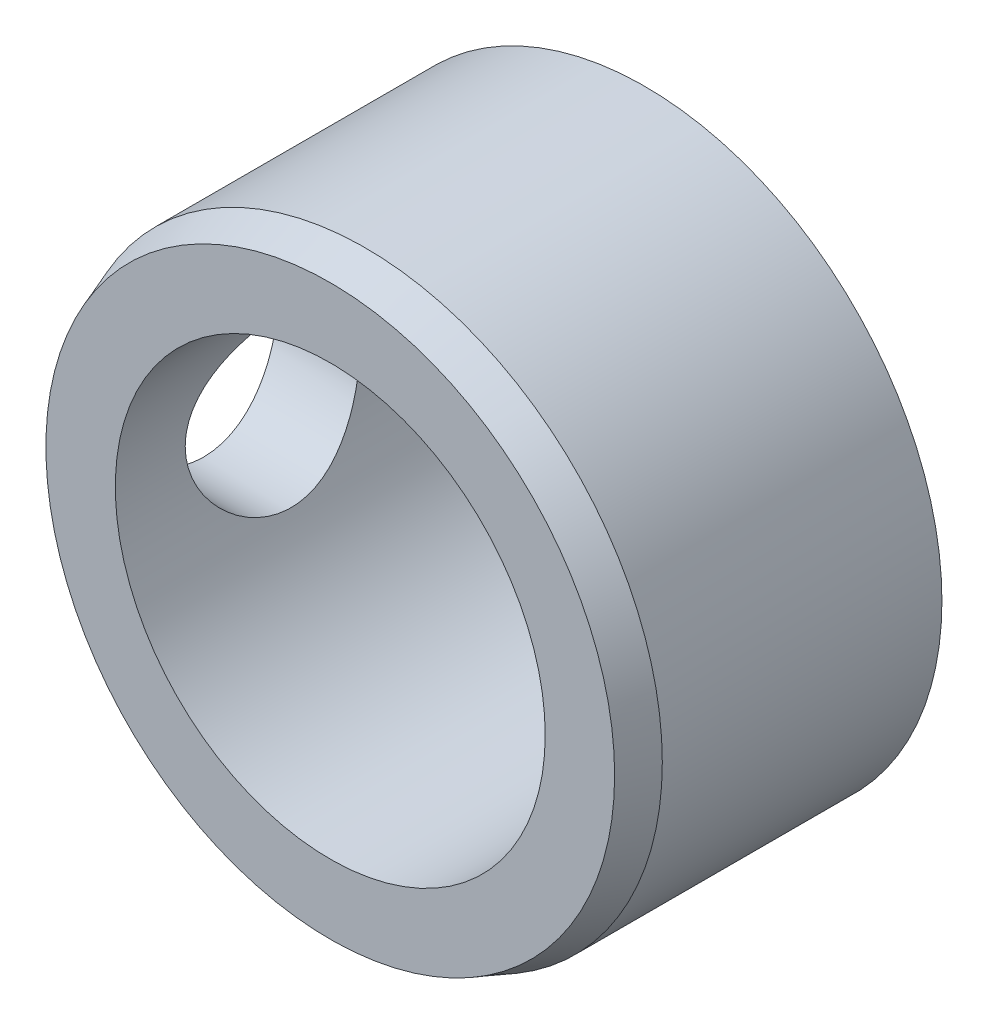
ISO-10303-21;
HEADER;
FILE_DESCRIPTION(('STEP AP214'),'2;1');
FILE_NAME('part.step','',(''),(''),'','','');
FILE_SCHEMA(('AUTOMOTIVE_DESIGN { 1 0 10303 214 1 1 1 1 }'));
ENDSEC;
DATA;
#1=APPLICATION_CONTEXT('core data for automotive mechanical design processes');
#2=APPLICATION_PROTOCOL_DEFINITION('international standard','automotive_design',2000,#1);
#3=PRODUCT_CONTEXT('',#1,'mechanical');
#4=PRODUCT('Part','Part','',(#3));
#5=PRODUCT_RELATED_PRODUCT_CATEGORY('part','',(#4));
#6=PRODUCT_DEFINITION_FORMATION('','',#4);
#7=PRODUCT_DEFINITION_CONTEXT('part definition',#1,'design');
#8=PRODUCT_DEFINITION('design','',#6,#7);
#9=PRODUCT_DEFINITION_SHAPE('','',#8);
#10=(LENGTH_UNIT() NAMED_UNIT(*) SI_UNIT(.MILLI.,.METRE.));
#11=(NAMED_UNIT(*) PLANE_ANGLE_UNIT() SI_UNIT($,.RADIAN.));
#12=(NAMED_UNIT(*) SI_UNIT($,.STERADIAN.) SOLID_ANGLE_UNIT());
#13=UNCERTAINTY_MEASURE_WITH_UNIT(LENGTH_MEASURE(1.E-05),#10,'distance_accuracy_value','');
#14=(GEOMETRIC_REPRESENTATION_CONTEXT(3) GLOBAL_UNCERTAINTY_ASSIGNED_CONTEXT((#13)) GLOBAL_UNIT_ASSIGNED_CONTEXT((#10,
#11,#12)) REPRESENTATION_CONTEXT('',''));
#15=CARTESIAN_POINT('',(0.,0.,0.));
#16=DIRECTION('',(0.,0.,1.));
#17=DIRECTION('',(1.,0.,0.));
#18=AXIS2_PLACEMENT_3D('',#15,#16,#17);
#19=CARTESIAN_POINT('',(0.,0.,18.));
#20=DIRECTION('',(0.,0.,-1.));
#21=DIRECTION('',(-1.,0.,0.));
#22=AXIS2_PLACEMENT_3D('',#19,#20,#21);
#23=CYLINDRICAL_SURFACE('',#22,17.);
#24=CARTESIAN_POINT('',(0.,0.,16.));
#25=DIRECTION('',(0.,0.,1.));
#26=DIRECTION('',(1.,0.,0.));
#27=AXIS2_PLACEMENT_3D('',#24,#25,#26);
#28=CIRCLE('',#27,17.);
#29=CARTESIAN_POINT('',(17.,0.,16.));
#30=VERTEX_POINT('',#29);
#31=EDGE_CURVE('E10',#30,#30,#28,.F.);
#32=ORIENTED_EDGE('',*,*,#31,.T.);
#33=EDGE_LOOP('',(#32));
#34=FACE_BOUND('',#33,.T.);
#35=CARTESIAN_POINT('',(0.,0.,0.));
#36=DIRECTION('',(0.,0.,1.));
#37=DIRECTION('',(1.,0.,0.));
#38=AXIS2_PLACEMENT_3D('',#35,#36,#37);
#39=CIRCLE('',#38,17.);
#40=CARTESIAN_POINT('',(17.,0.,0.));
#41=VERTEX_POINT('',#40);
#42=EDGE_CURVE('E53',#41,#41,#39,.T.);
#43=ORIENTED_EDGE('',*,*,#42,.T.);
#44=EDGE_LOOP('',(#43));
#45=FACE_BOUND('',#44,.T.);
#46=CARTESIAN_POINT('',(-17.,0.,14.));
#47=CARTESIAN_POINT('',(-16.9999972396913,0.274542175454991,13.9999960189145));
#48=CARTESIAN_POINT('',(-16.9932854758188,0.549124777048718,13.9773128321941));
#49=CARTESIAN_POINT('',(-16.9671658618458,1.09030958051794,13.8873845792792));
#50=CARTESIAN_POINT('',(-16.9477538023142,1.35690910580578,13.8201247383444));
#51=CARTESIAN_POINT('',(-16.8983635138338,1.87424279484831,13.6434716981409));
#52=CARTESIAN_POINT('',(-16.8684005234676,2.12499922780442,13.5341392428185));
#53=CARTESIAN_POINT('',(-16.8010321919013,2.60462027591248,13.2766892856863));
#54=CARTESIAN_POINT('',(-16.7636259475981,2.83348222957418,13.1285670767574));
#55=CARTESIAN_POINT('',(-16.6842112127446,3.26915832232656,12.7934165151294));
#56=CARTESIAN_POINT('',(-16.6421111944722,3.47528005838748,12.6055098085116));
#57=CARTESIAN_POINT('',(-16.558607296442,3.8535869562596,12.197997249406));
#58=CARTESIAN_POINT('',(-16.5172035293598,4.02576667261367,11.9783863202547));
#59=CARTESIAN_POINT('',(-16.4388177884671,4.33489560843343,11.5079021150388));
#60=CARTESIAN_POINT('',(-16.4019498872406,4.47100870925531,11.2564586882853));
#61=CARTESIAN_POINT('',(-16.3381741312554,4.69873934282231,10.7329924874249));
#62=CARTESIAN_POINT('',(-16.3112639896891,4.79036709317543,10.4609744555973));
#63=CARTESIAN_POINT('',(-16.2714028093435,4.92404618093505,9.91183715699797));
#64=CARTESIAN_POINT('',(-16.2580942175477,4.96737026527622,9.63505435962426));
#65=CARTESIAN_POINT('',(-16.2458784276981,5.0071854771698,9.07785359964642));
#66=CARTESIAN_POINT('',(-16.2469678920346,5.00368745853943,8.79743649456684));
#67=CARTESIAN_POINT('',(-16.2631076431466,4.95095940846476,8.25119811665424));
#68=CARTESIAN_POINT('',(-16.2776742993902,4.90331354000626,7.98520728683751));
#69=CARTESIAN_POINT('',(-16.3183462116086,4.76619765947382,7.46517447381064));
#70=CARTESIAN_POINT('',(-16.3444525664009,4.67672366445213,7.21113363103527));
#71=CARTESIAN_POINT('',(-16.4056554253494,4.45730211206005,6.71829070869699));
#72=CARTESIAN_POINT('',(-16.4408666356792,4.326833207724,6.47973559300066));
#73=CARTESIAN_POINT('',(-16.5162554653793,4.02948792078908,6.02736924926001));
#74=CARTESIAN_POINT('',(-16.5564342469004,3.86260301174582,5.81356383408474));
#75=CARTESIAN_POINT('',(-16.6392021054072,3.48925235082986,5.40776826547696));
#76=CARTESIAN_POINT('',(-16.6818232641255,3.28146894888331,5.21699493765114));
#77=CARTESIAN_POINT('',(-16.7632443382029,2.83632910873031,4.87272397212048));
#78=CARTESIAN_POINT('',(-16.8020440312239,2.59897095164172,4.71922850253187));
#79=CARTESIAN_POINT('',(-16.8717818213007,2.09926848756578,4.45316996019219));
#80=CARTESIAN_POINT('',(-16.9026694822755,1.83677785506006,4.34086760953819));
#81=CARTESIAN_POINT('',(-16.9527396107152,1.29551766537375,4.16235794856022));
#82=CARTESIAN_POINT('',(-16.9719252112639,1.01675248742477,4.09613829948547));
#83=CARTESIAN_POINT('',(-16.9959379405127,0.461208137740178,4.0136782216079));
#84=CARTESIAN_POINT('',(-17.0012389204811,0.18469399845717,3.99578773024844));
#85=CARTESIAN_POINT('',(-16.9982701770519,-0.367399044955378,4.00588146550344));
#86=CARTESIAN_POINT('',(-16.9900021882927,-0.642978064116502,4.03385982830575));
#87=CARTESIAN_POINT('',(-16.961134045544,-1.17921271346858,4.13355888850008));
#88=CARTESIAN_POINT('',(-16.9408036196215,-1.44006199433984,4.20432348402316));
#89=CARTESIAN_POINT('',(-16.8901536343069,-1.94613518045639,4.3864433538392));
#90=CARTESIAN_POINT('',(-16.8598328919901,-2.19135723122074,4.49780343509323));
#91=CARTESIAN_POINT('',(-16.7915033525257,-2.66534944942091,4.76077579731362));
#92=CARTESIAN_POINT('',(-16.7533367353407,-2.8936244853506,4.91323842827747));
#93=CARTESIAN_POINT('',(-16.673704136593,-3.32191560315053,5.25304844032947));
#94=CARTESIAN_POINT('',(-16.6322373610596,-3.52192485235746,5.4404042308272));
#95=CARTESIAN_POINT('',(-16.5488725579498,-3.89521688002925,5.85242814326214));
#96=CARTESIAN_POINT('',(-16.5070097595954,-4.06732704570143,6.07816802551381));
#97=CARTESIAN_POINT('',(-16.4291353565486,-4.37129517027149,6.55623274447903));
#98=CARTESIAN_POINT('',(-16.3931235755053,-4.50315434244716,6.80855677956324));
#99=CARTESIAN_POINT('',(-16.3314467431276,-4.72194711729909,7.33171455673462));
#100=CARTESIAN_POINT('',(-16.3057305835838,-4.80910325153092,7.60244886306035));
#101=CARTESIAN_POINT('',(-16.26766584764,-4.93634927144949,8.15564231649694));
#102=CARTESIAN_POINT('',(-16.2553129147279,-4.97645449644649,8.43809761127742));
#103=CARTESIAN_POINT('',(-16.2457908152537,-5.00744547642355,8.99456751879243));
#104=CARTESIAN_POINT('',(-16.2480335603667,-5.00023747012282,9.26846732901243));
#105=CARTESIAN_POINT('',(-16.2660429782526,-4.94133317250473,9.81096453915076));
#106=CARTESIAN_POINT('',(-16.2818091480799,-4.88963853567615,10.0795621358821));
#107=CARTESIAN_POINT('',(-16.3247022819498,-4.74443717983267,10.600847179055));
#108=CARTESIAN_POINT('',(-16.3516969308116,-4.65141659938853,10.8536817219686));
#109=CARTESIAN_POINT('',(-16.413985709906,-4.42658103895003,11.3403567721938));
#110=CARTESIAN_POINT('',(-16.4492813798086,-4.2947588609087,11.5741937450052));
#111=CARTESIAN_POINT('',(-16.525744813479,-3.99063021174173,12.0251290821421));
#112=CARTESIAN_POINT('',(-16.5670754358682,-3.81706300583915,12.2413495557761));
#113=CARTESIAN_POINT('',(-16.6501406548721,-3.43666397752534,12.6422138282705));
#114=CARTESIAN_POINT('',(-16.6918753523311,-3.22982363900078,12.8268495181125));
#115=CARTESIAN_POINT('',(-16.7724327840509,-2.78184131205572,13.1643920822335));
#116=CARTESIAN_POINT('',(-16.8111427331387,-2.53990743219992,13.3162775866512));
#117=CARTESIAN_POINT('',(-16.8799593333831,-2.03279874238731,13.5769984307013));
#118=CARTESIAN_POINT('',(-16.9100702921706,-1.7676356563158,13.6858553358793));
#119=CARTESIAN_POINT('',(-16.9554297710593,-1.25377523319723,13.8468355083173));
#120=CARTESIAN_POINT('',(-16.97200860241,-1.00680227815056,13.9041208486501));
#121=CARTESIAN_POINT('',(-16.9942941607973,-0.506563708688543,13.9807020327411));
#122=CARTESIAN_POINT('',(-17.0000025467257,-0.253299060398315,14.000003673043));
#123=CARTESIAN_POINT('',(-17.,0.,14.));
#124=B_SPLINE_CURVE_WITH_KNOTS('',3,(#46,#47,#48,#49,#50,#51,#52,#53,#54,#55,#56,#57,#58,#59,
#60,#61,#62,#63,#64,#65,#66,#67,#68,#69,#70,#71,#72,#73,#74,#75,#76,#77,#78,#79,#80,#81,#82,#83,
#84,#85,#86,#87,#88,#89,#90,#91,#92,#93,#94,#95,#96,#97,#98,#99,#100,#101,#102,#103,#104,#105,
#106,#107,#108,#109,#110,#111,#112,#113,#114,#115,#116,#117,#118,#119,#120,#121,#122,#123),
.UNSPECIFIED.,.T.,.F.,(4,2,2,2,2,2,2,2,2,2,2,2,2,2,2,2,2,2,2,2,2,2,2,2,2,2,2,2,2,2,2,2,2,2,2,2,
2,2,4),(0.,0.822696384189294,1.64566558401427,2.46745102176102,3.28933622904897,
4.13172361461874,4.97424603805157,5.83486437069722,6.69528493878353,7.53245524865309,
8.36943149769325,9.17749119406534,9.98562785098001,10.8044888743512,11.623541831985,
12.4754016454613,13.3273109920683,14.18452287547,15.0415051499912,15.8688347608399,
16.6960586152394,17.5054473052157,18.3149318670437,19.1426539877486,19.9705758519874,
20.8273157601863,21.6840298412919,22.5364367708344,23.3885657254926,24.2065793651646,
25.024562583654,25.8331682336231,26.6419239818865,27.4791225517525,28.3165357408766,
29.1771614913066,30.0373553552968,30.796510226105,31.5555492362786),.UNSPECIFIED.);
#125=CARTESIAN_POINT('',(-17.,0.,14.));
#126=VERTEX_POINT('',#125);
#127=EDGE_CURVE('E64',#126,#126,#124,.T.);
#128=ORIENTED_EDGE('',*,*,#127,.F.);
#129=EDGE_LOOP('',(#128));
#130=FACE_BOUND('',#129,.T.);
#131=ADVANCED_FACE('F37',(#34,#45,#130),#23,.T.);
#132=CARTESIAN_POINT('',(0.,0.,0.));
#133=DIRECTION('',(0.,0.,1.));
#134=DIRECTION('',(1.,0.,0.));
#135=AXIS2_PLACEMENT_3D('',#132,#133,#134);
#136=CYLINDRICAL_SURFACE('',#135,12.3);
#137=CARTESIAN_POINT('',(0.,0.,18.));
#138=DIRECTION('',(0.,0.,1.));
#139=DIRECTION('',(1.,0.,0.));
#140=AXIS2_PLACEMENT_3D('',#137,#138,#139);
#141=CIRCLE('',#140,12.3);
#142=CARTESIAN_POINT('',(12.3,0.,18.));
#143=VERTEX_POINT('',#142);
#144=EDGE_CURVE('E61',#143,#143,#141,.T.);
#145=ORIENTED_EDGE('',*,*,#144,.T.);
#146=EDGE_LOOP('',(#145));
#147=FACE_BOUND('',#146,.T.);
#148=CARTESIAN_POINT('',(0.,0.,0.));
#149=DIRECTION('',(0.,0.,1.));
#150=DIRECTION('',(1.,0.,0.));
#151=AXIS2_PLACEMENT_3D('',#148,#149,#150);
#152=CIRCLE('',#151,12.3);
#153=CARTESIAN_POINT('',(12.3,0.,0.));
#154=VERTEX_POINT('',#153);
#155=EDGE_CURVE('E58',#154,#154,#152,.T.);
#156=ORIENTED_EDGE('',*,*,#155,.F.);
#157=EDGE_LOOP('',(#156));
#158=FACE_BOUND('',#157,.T.);
#159=CARTESIAN_POINT('',(-12.3,0.,14.));
#160=CARTESIAN_POINT('',(-12.299999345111,-0.134251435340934,13.9999991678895));
#161=CARTESIAN_POINT('',(-12.297795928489,-0.268552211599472,13.9945855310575));
#162=CARTESIAN_POINT('',(-12.2890373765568,-0.536201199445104,13.9729804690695));
#163=CARTESIAN_POINT('',(-12.2824793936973,-0.669548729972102,13.9567819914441));
#164=CARTESIAN_POINT('',(-12.2651667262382,-0.934530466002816,13.913726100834));
#165=CARTESIAN_POINT('',(-12.2544031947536,-1.06616045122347,13.8868462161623));
#166=CARTESIAN_POINT('',(-12.228959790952,-1.32652358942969,13.8226884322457));
#167=CARTESIAN_POINT('',(-12.214278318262,-1.45525553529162,13.785406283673));
#168=CARTESIAN_POINT('',(-12.181439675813,-1.70843595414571,13.7009553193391));
#169=CARTESIAN_POINT('',(-12.1632957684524,-1.83289870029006,13.653824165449));
#170=CARTESIAN_POINT('',(-12.1239527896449,-2.07728767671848,13.5500034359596));
#171=CARTESIAN_POINT('',(-12.1027525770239,-2.19721219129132,13.4933102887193));
#172=CARTESIAN_POINT('',(-12.0353555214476,-2.54891907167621,13.3096188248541));
#173=CARTESIAN_POINT('',(-11.9853151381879,-2.77298158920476,13.1688918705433));
#174=CARTESIAN_POINT('',(-11.877399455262,-3.20455622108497,12.8479148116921));
#175=CARTESIAN_POINT('',(-11.8192760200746,-3.41090339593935,12.6661959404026));
#176=CARTESIAN_POINT('',(-11.7028078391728,-3.79128869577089,12.2712696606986));
#177=CARTESIAN_POINT('',(-11.6444629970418,-3.96531055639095,12.058046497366));
#178=CARTESIAN_POINT('',(-11.5601834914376,-4.20233997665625,11.7131318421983));
#179=CARTESIAN_POINT('',(-11.5320468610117,-4.27874761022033,11.5909726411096));
#180=CARTESIAN_POINT('',(-11.4782893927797,-4.42093201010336,11.3401098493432));
#181=CARTESIAN_POINT('',(-11.452667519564,-4.48671315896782,11.2114089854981));
#182=CARTESIAN_POINT('',(-11.404779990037,-4.6070810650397,10.9482672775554));
#183=CARTESIAN_POINT('',(-11.3825145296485,-4.66166716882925,10.8138260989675));
#184=CARTESIAN_POINT('',(-11.3421317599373,-4.75907860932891,10.5402086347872));
#185=CARTESIAN_POINT('',(-11.3240123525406,-4.80190989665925,10.4010347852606));
#186=CARTESIAN_POINT('',(-11.2933071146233,-4.8736708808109,10.1254610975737));
#187=CARTESIAN_POINT('',(-11.2805050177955,-4.90314958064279,9.9892283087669));
#188=CARTESIAN_POINT('',(-11.2597389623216,-4.95065178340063,9.71447315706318));
#189=CARTESIAN_POINT('',(-11.2517727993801,-4.9686805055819,9.57595186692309));
#190=CARTESIAN_POINT('',(-11.2409660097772,-4.99308143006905,9.29771805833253));
#191=CARTESIAN_POINT('',(-11.2381242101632,-4.99945629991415,9.15800581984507));
#192=CARTESIAN_POINT('',(-11.2376702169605,-5.00047694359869,8.87853354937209));
#193=CARTESIAN_POINT('',(-11.2400577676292,-4.99512329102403,8.73877352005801));
#194=CARTESIAN_POINT('',(-11.2496101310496,-4.97356967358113,8.47049089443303));
#195=CARTESIAN_POINT('',(-11.2564156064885,-4.95818519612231,8.34188896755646));
#196=CARTESIAN_POINT('',(-11.2742287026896,-4.91754601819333,8.08650898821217));
#197=CARTESIAN_POINT('',(-11.2852377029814,-4.89228807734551,7.95973154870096));
#198=CARTESIAN_POINT('',(-11.3111165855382,-4.83215395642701,7.70891109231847));
#199=CARTESIAN_POINT('',(-11.3259855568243,-4.79728004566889,7.58486743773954));
#200=CARTESIAN_POINT('',(-11.359141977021,-4.71823301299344,7.34023236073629));
#201=CARTESIAN_POINT('',(-11.3774307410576,-4.67405631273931,7.21964228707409));
#202=CARTESIAN_POINT('',(-11.4374788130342,-4.52610348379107,6.85929921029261));
#203=CARTESIAN_POINT('',(-11.4838742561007,-4.40810797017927,6.62597561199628));
#204=CARTESIAN_POINT('',(-11.5838603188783,-4.13821413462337,6.1816859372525));
#205=CARTESIAN_POINT('',(-11.6374536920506,-3.98630282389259,5.97072847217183));
#206=CARTESIAN_POINT('',(-11.751028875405,-3.63859580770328,5.55923690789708));
#207=CARTESIAN_POINT('',(-11.8111786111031,-3.44026022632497,5.36088986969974));
#208=CARTESIAN_POINT('',(-11.9274734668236,-3.01236694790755,4.99950264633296));
#209=CARTESIAN_POINT('',(-11.9836177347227,-2.78280263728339,4.83646995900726));
#210=CARTESIAN_POINT('',(-12.0608933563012,-2.41680734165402,4.62052996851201));
#211=CARTESIAN_POINT('',(-12.0857228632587,-2.28971386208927,4.55275065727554));
#212=CARTESIAN_POINT('',(-12.1320984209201,-2.02967640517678,4.42822124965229));
#213=CARTESIAN_POINT('',(-12.1536457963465,-1.89673481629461,4.37146670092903));
#214=CARTESIAN_POINT('',(-12.1928247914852,-1.62595874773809,4.26954670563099));
#215=CARTESIAN_POINT('',(-12.2104572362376,-1.48812530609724,4.22437881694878));
#216=CARTESIAN_POINT('',(-12.2412854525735,-1.20859111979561,4.14609780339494));
#217=CARTESIAN_POINT('',(-12.2544815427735,-1.06689065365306,4.11298381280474));
#218=CARTESIAN_POINT('',(-12.2753763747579,-0.789489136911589,4.06083015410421));
#219=CARTESIAN_POINT('',(-12.2833605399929,-0.65394703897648,4.04105726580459));
#220=CARTESIAN_POINT('',(-12.2948376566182,-0.381511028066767,4.0126958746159));
#221=CARTESIAN_POINT('',(-12.2983308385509,-0.244617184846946,4.00410679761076));
#222=CARTESIAN_POINT('',(-12.3007278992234,0.0294214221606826,3.99820893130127));
#223=CARTESIAN_POINT('',(-12.2996328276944,0.166566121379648,4.00089756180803));
#224=CARTESIAN_POINT('',(-12.2928865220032,0.440057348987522,4.01751899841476));
#225=CARTESIAN_POINT('',(-12.2872353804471,0.576403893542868,4.03145157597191));
#226=CARTESIAN_POINT('',(-12.2719047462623,0.84087393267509,4.06948964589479));
#227=CARTESIAN_POINT('',(-12.2624270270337,0.969082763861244,4.09308634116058));
#228=CARTESIAN_POINT('',(-12.2397119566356,1.22299050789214,4.15013064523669));
#229=CARTESIAN_POINT('',(-12.2264733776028,1.34868858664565,4.18358147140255));
#230=CARTESIAN_POINT('',(-12.1965631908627,1.59669505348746,4.26002196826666));
#231=CARTESIAN_POINT('',(-12.1798925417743,1.71900437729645,4.30300897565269));
#232=CARTESIAN_POINT('',(-12.1435167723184,1.95954960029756,4.39816095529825));
#233=CARTESIAN_POINT('',(-12.1238104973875,2.07778392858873,4.4503294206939));
#234=CARTESIAN_POINT('',(-12.0595257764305,2.43238523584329,4.62347667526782));
#235=CARTESIAN_POINT('',(-12.0107173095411,2.66118345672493,4.75879643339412));
#236=CARTESIAN_POINT('',(-11.9067120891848,3.09351645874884,5.06297460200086));
#237=CARTESIAN_POINT('',(-11.8515127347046,3.29704088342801,5.23184668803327));
#238=CARTESIAN_POINT('',(-11.7360439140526,3.68775318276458,5.61182932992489));
#239=CARTESIAN_POINT('',(-11.6756852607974,3.87288297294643,5.82503390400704));
#240=CARTESIAN_POINT('',(-11.5601209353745,4.20531673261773,6.28067313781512));
#241=CARTESIAN_POINT('',(-11.5049162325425,4.35261359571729,6.52311327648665));
#242=CARTESIAN_POINT('',(-11.4307004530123,4.54244025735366,6.90551037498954));
#243=CARTESIAN_POINT('',(-11.4072760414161,4.60079172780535,7.03697188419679));
#244=CARTESIAN_POINT('',(-11.3642296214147,4.7061159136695,7.30495892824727));
#245=CARTESIAN_POINT('',(-11.3446059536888,4.75309359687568,7.44148222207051));
#246=CARTESIAN_POINT('',(-11.3098728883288,4.83515902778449,7.71855094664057));
#247=CARTESIAN_POINT('',(-11.2947616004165,4.87025175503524,7.85909466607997));
#248=CARTESIAN_POINT('',(-11.2696148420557,4.92816218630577,8.14313551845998));
#249=CARTESIAN_POINT('',(-11.2595789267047,4.95098096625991,8.28663239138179));
#250=CARTESIAN_POINT('',(-11.2455202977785,4.98282551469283,8.56462732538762));
#251=CARTESIAN_POINT('',(-11.241106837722,4.99274868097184,8.69900354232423));
#252=CARTESIAN_POINT('',(-11.237121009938,5.00171342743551,8.96823954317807));
#253=CARTESIAN_POINT('',(-11.2375502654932,5.00075135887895,9.10309947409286));
#254=CARTESIAN_POINT('',(-11.2432380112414,4.98795018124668,9.37212841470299));
#255=CARTESIAN_POINT('',(-11.2484940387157,4.97611661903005,9.50629774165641));
#256=CARTESIAN_POINT('',(-11.2636513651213,4.94171123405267,9.77303438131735));
#257=CARTESIAN_POINT('',(-11.2735544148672,4.91913536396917,9.90560107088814));
#258=CARTESIAN_POINT('',(-11.2971578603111,4.86467520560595,10.1625101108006));
#259=CARTESIAN_POINT('',(-11.310678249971,4.83322907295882,10.2869620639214));
#260=CARTESIAN_POINT('',(-11.3412640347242,4.76101455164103,10.5326991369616));
#261=CARTESIAN_POINT('',(-11.3583306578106,4.7202429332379,10.6539831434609));
#262=CARTESIAN_POINT('',(-11.4141396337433,4.58443575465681,11.01195605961));
#263=CARTESIAN_POINT('',(-11.4575089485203,4.47586877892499,11.2429482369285));
#264=CARTESIAN_POINT('',(-11.5548010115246,4.21859179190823,11.6973544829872));
#265=CARTESIAN_POINT('',(-11.6091922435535,4.06790731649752,11.9195376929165));
#266=CARTESIAN_POINT('',(-11.7210585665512,3.73333598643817,12.3367074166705));
#267=CARTESIAN_POINT('',(-11.7785346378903,3.54943853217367,12.5316852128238));
#268=CARTESIAN_POINT('',(-11.8647076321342,3.24513417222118,12.8065142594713));
#269=CARTESIAN_POINT('',(-11.8943472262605,3.13501910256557,12.8977084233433));
#270=CARTESIAN_POINT('',(-11.9520850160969,2.90713856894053,13.0704990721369));
#271=CARTESIAN_POINT('',(-11.9801837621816,2.78937586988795,13.1520989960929));
#272=CARTESIAN_POINT('',(-12.0340901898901,2.54678816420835,13.3051673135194));
#273=CARTESIAN_POINT('',(-12.0598957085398,2.42195666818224,13.376626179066));
#274=CARTESIAN_POINT('',(-12.1084516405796,2.16617872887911,13.5086995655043));
#275=CARTESIAN_POINT('',(-12.131203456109,2.03523512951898,13.5693190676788));
#276=CARTESIAN_POINT('',(-12.1726454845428,1.77040965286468,13.6782251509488));
#277=CARTESIAN_POINT('',(-12.1913994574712,1.63661849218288,13.7267078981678));
#278=CARTESIAN_POINT('',(-12.2247925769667,1.36497550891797,13.8121826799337));
#279=CARTESIAN_POINT('',(-12.2394336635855,1.22712563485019,13.8491801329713));
#280=CARTESIAN_POINT('',(-12.2641505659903,0.948732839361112,13.9112317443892));
#281=CARTESIAN_POINT('',(-12.2742377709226,0.808197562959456,13.9363157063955));
#282=CARTESIAN_POINT('',(-12.2895926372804,0.525307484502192,13.9743736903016));
#283=CARTESIAN_POINT('',(-12.2948639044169,0.382954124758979,13.9873567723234));
#284=CARTESIAN_POINT('',(-12.2984343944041,0.200298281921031,13.996147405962));
#285=CARTESIAN_POINT('',(-12.2990212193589,0.160255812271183,13.9975917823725));
#286=CARTESIAN_POINT('',(-12.2998041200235,0.0801436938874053,13.9995182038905));
#287=CARTESIAN_POINT('',(-12.3000001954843,0.0400740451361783,14.0000002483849));
#288=CARTESIAN_POINT('',(-12.3,0.,14.));
#289=B_SPLINE_CURVE_WITH_KNOTS('',3,(#159,#160,#161,#162,#163,#164,#165,#166,#167,#168,#169,
#170,#171,#172,#173,#174,#175,#176,#177,#178,#179,#180,#181,#182,#183,#184,#185,#186,#187,#188,
#189,#190,#191,#192,#193,#194,#195,#196,#197,#198,#199,#200,#201,#202,#203,#204,#205,#206,#207,
#208,#209,#210,#211,#212,#213,#214,#215,#216,#217,#218,#219,#220,#221,#222,#223,#224,#225,#226,
#227,#228,#229,#230,#231,#232,#233,#234,#235,#236,#237,#238,#239,#240,#241,#242,#243,#244,#245,
#246,#247,#248,#249,#250,#251,#252,#253,#254,#255,#256,#257,#258,#259,#260,#261,#262,#263,#264,
#265,#266,#267,#268,#269,#270,#271,#272,#273,#274,#275,#276,#277,#278,#279,#280,#281,#282,#283,
#284,#285,#286,#287,#288),.UNSPECIFIED.,.T.,.F.,(4,2,2,2,2,2,2,2,2,2,2,2,2,2,2,2,2,2,2,2,2,2,2,
2,2,2,2,2,2,2,2,2,2,2,2,2,2,2,2,2,2,2,2,2,2,2,2,2,2,2,2,2,2,2,2,2,2,2,2,2,2,2,2,2,4),(0.,
0.402713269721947,0.80569014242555,1.20951933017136,1.613513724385,2.01599065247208,
2.41861824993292,3.22277966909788,4.06238927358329,4.90242018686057,5.34238819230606,
5.78217428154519,6.22198603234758,6.66157472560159,7.08093524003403,7.50010445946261,
7.91917772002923,8.33823048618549,8.72686624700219,9.11562966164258,9.50430140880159,
9.89312293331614,10.6861079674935,11.4793972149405,12.3362046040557,13.1931937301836,
13.6312061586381,14.0690413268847,14.5067841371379,14.94449550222,15.355597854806,
15.7666791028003,16.1776663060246,16.5886451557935,16.980311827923,17.3721065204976,
17.7637919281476,18.1556266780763,18.9626325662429,19.7699680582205,20.6323142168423,
21.4948222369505,21.9315156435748,22.3680179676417,22.8043371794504,23.2406181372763,
23.6445443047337,24.0486058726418,24.4524613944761,24.8564691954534,25.2432429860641,
25.6301509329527,26.4034111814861,27.2218406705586,28.0405318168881,28.4781381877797,
28.915587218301,29.3534445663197,29.7911001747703,30.2211437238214,30.6509840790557,
31.0797433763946,31.5081813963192,31.6283912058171,31.7486010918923),.UNSPECIFIED.);
#290=CARTESIAN_POINT('',(-12.3,0.,14.));
#291=VERTEX_POINT('',#290);
#292=EDGE_CURVE('E41',#291,#291,#289,.T.);
#293=ORIENTED_EDGE('',*,*,#292,.F.);
#294=EDGE_LOOP('',(#293));
#295=FACE_BOUND('',#294,.T.);
#296=ADVANCED_FACE('F78',(#147,#158,#295),#136,.F.);
#297=CARTESIAN_POINT('',(0.,0.,18.));
#298=DIRECTION('',(0.,0.,1.));
#299=DIRECTION('',(1.,0.,0.));
#300=AXIS2_PLACEMENT_3D('',#297,#298,#299);
#301=PLANE('',#300);
#302=CARTESIAN_POINT('',(0.,0.,18.));
#303=DIRECTION('',(0.,0.,1.));
#304=DIRECTION('',(1.,0.,0.));
#305=AXIS2_PLACEMENT_3D('',#302,#303,#304);
#306=CIRCLE('',#305,16.2720595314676);
#307=CARTESIAN_POINT('',(16.2720595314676,0.,18.));
#308=VERTEX_POINT('',#307);
#309=EDGE_CURVE('E49',#308,#308,#306,.T.);
#310=ORIENTED_EDGE('',*,*,#309,.T.);
#311=EDGE_LOOP('',(#310));
#312=FACE_BOUND('',#311,.T.);
#313=ORIENTED_EDGE('',*,*,#144,.F.);
#314=EDGE_LOOP('',(#313));
#315=FACE_BOUND('',#314,.T.);
#316=ADVANCED_FACE('F82',(#312,#315),#301,.T.);
#317=CARTESIAN_POINT('',(0.,0.,0.));
#318=DIRECTION('',(0.,0.,1.));
#319=DIRECTION('',(1.,0.,0.));
#320=AXIS2_PLACEMENT_3D('',#317,#318,#319);
#321=PLANE('',#320);
#322=ORIENTED_EDGE('',*,*,#155,.T.);
#323=EDGE_LOOP('',(#322));
#324=FACE_BOUND('',#323,.T.);
#325=ORIENTED_EDGE('',*,*,#42,.F.);
#326=EDGE_LOOP('',(#325));
#327=FACE_BOUND('',#326,.T.);
#328=ADVANCED_FACE('F76',(#324,#327),#321,.F.);
#329=CARTESIAN_POINT('',(0.,0.,18.));
#330=DIRECTION('',(0.,0.,-1.));
#331=DIRECTION('',(-1.,0.,0.));
#332=AXIS2_PLACEMENT_3D('',#329,#330,#331);
#333=CONICAL_SURFACE('',#332,16.2720595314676,0.349065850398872);
#334=ORIENTED_EDGE('',*,*,#31,.F.);
#335=EDGE_LOOP('',(#334));
#336=FACE_BOUND('',#335,.T.);
#337=ORIENTED_EDGE('',*,*,#309,.F.);
#338=EDGE_LOOP('',(#337));
#339=FACE_BOUND('',#338,.T.);
#340=ADVANCED_FACE('F72',(#336,#339),#333,.T.);
#341=CARTESIAN_POINT('',(-7.,0.,9.));
#342=DIRECTION('',(-1.,0.,0.));
#343=DIRECTION('',(0.,0.,1.));
#344=AXIS2_PLACEMENT_3D('',#341,#342,#343);
#345=CYLINDRICAL_SURFACE('',#344,5.);
#346=ORIENTED_EDGE('',*,*,#292,.T.);
#347=EDGE_LOOP('',(#346));
#348=FACE_BOUND('',#347,.T.);
#349=ORIENTED_EDGE('',*,*,#127,.T.);
#350=EDGE_LOOP('',(#349));
#351=FACE_BOUND('',#350,.T.);
#352=ADVANCED_FACE('F68',(#348,#351),#345,.F.);
#353=CLOSED_SHELL('',(#131,#296,#316,#328,#340,#352));
#354=MANIFOLD_SOLID_BREP('B2',#353);
#355=ADVANCED_BREP_SHAPE_REPRESENTATION('',(#18,#354),#14);
#356=SHAPE_DEFINITION_REPRESENTATION(#9,#355);
ENDSEC;
END-ISO-10303-21;
